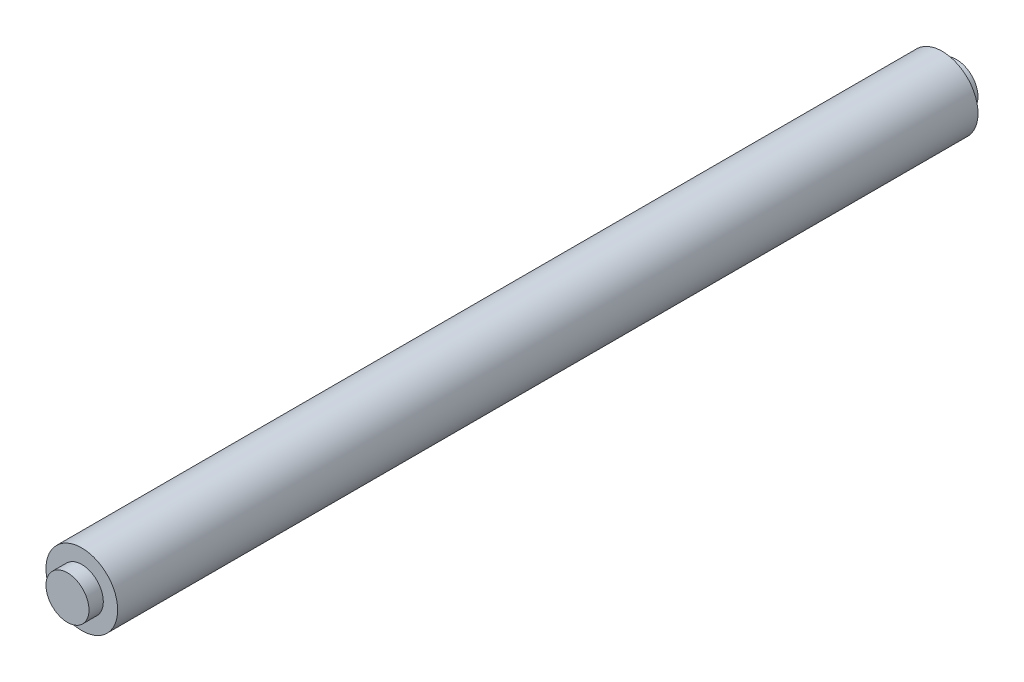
ISO-10303-21;
HEADER;
FILE_DESCRIPTION(('STEP AP214'),'2;1');
FILE_NAME('part.step','',(''),(''),'','','');
FILE_SCHEMA(('AUTOMOTIVE_DESIGN { 1 0 10303 214 1 1 1 1 }'));
ENDSEC;
DATA;
#1=APPLICATION_CONTEXT('core data for automotive mechanical design processes');
#2=APPLICATION_PROTOCOL_DEFINITION('international standard','automotive_design',2000,#1);
#3=PRODUCT_CONTEXT('',#1,'mechanical');
#4=PRODUCT('Part','Part','',(#3));
#5=PRODUCT_RELATED_PRODUCT_CATEGORY('part','',(#4));
#6=PRODUCT_DEFINITION_FORMATION('','',#4);
#7=PRODUCT_DEFINITION_CONTEXT('part definition',#1,'design');
#8=PRODUCT_DEFINITION('design','',#6,#7);
#9=PRODUCT_DEFINITION_SHAPE('','',#8);
#10=(LENGTH_UNIT() NAMED_UNIT(*) SI_UNIT(.MILLI.,.METRE.));
#11=(NAMED_UNIT(*) PLANE_ANGLE_UNIT() SI_UNIT($,.RADIAN.));
#12=(NAMED_UNIT(*) SI_UNIT($,.STERADIAN.) SOLID_ANGLE_UNIT());
#13=UNCERTAINTY_MEASURE_WITH_UNIT(LENGTH_MEASURE(1.E-05),#10,'distance_accuracy_value','');
#14=(GEOMETRIC_REPRESENTATION_CONTEXT(3) GLOBAL_UNCERTAINTY_ASSIGNED_CONTEXT((#13)) GLOBAL_UNIT_ASSIGNED_CONTEXT((#10,
#11,#12)) REPRESENTATION_CONTEXT('',''));
#15=CARTESIAN_POINT('',(0.,0.,0.));
#16=DIRECTION('',(0.,0.,1.));
#17=DIRECTION('',(1.,0.,0.));
#18=AXIS2_PLACEMENT_3D('',#15,#16,#17);
#19=CARTESIAN_POINT('',(0.,0.,600.));
#20=DIRECTION('',(0.,0.,-1.));
#21=DIRECTION('',(-1.,0.,0.));
#22=AXIS2_PLACEMENT_3D('',#19,#20,#21);
#23=CYLINDRICAL_SURFACE('',#22,25.);
#24=CARTESIAN_POINT('',(0.,0.,600.));
#25=DIRECTION('',(0.,0.,1.));
#26=DIRECTION('',(1.,0.,0.));
#27=AXIS2_PLACEMENT_3D('',#24,#25,#26);
#28=CIRCLE('',#27,25.);
#29=CARTESIAN_POINT('',(25.,0.,600.));
#30=VERTEX_POINT('',#29);
#31=EDGE_CURVE('E51',#30,#30,#28,.T.);
#32=ORIENTED_EDGE('',*,*,#31,.F.);
#33=EDGE_LOOP('',(#32));
#34=FACE_BOUND('',#33,.T.);
#35=CARTESIAN_POINT('',(0.,0.,0.));
#36=DIRECTION('',(0.,0.,1.));
#37=DIRECTION('',(1.,0.,0.));
#38=AXIS2_PLACEMENT_3D('',#35,#36,#37);
#39=CIRCLE('',#38,25.);
#40=CARTESIAN_POINT('',(25.,0.,0.));
#41=VERTEX_POINT('',#40);
#42=EDGE_CURVE('E40',#41,#41,#39,.T.);
#43=ORIENTED_EDGE('',*,*,#42,.T.);
#44=EDGE_LOOP('',(#43));
#45=FACE_BOUND('',#44,.T.);
#46=ADVANCED_FACE('F37',(#34,#45),#23,.T.);
#47=CARTESIAN_POINT('',(0.,0.,600.));
#48=DIRECTION('',(0.,0.,1.));
#49=DIRECTION('',(1.,0.,0.));
#50=AXIS2_PLACEMENT_3D('',#47,#48,#49);
#51=PLANE('',#50);
#52=CARTESIAN_POINT('',(0.,0.,600.));
#53=DIRECTION('',(0.,0.,1.));
#54=DIRECTION('',(1.,0.,0.));
#55=AXIS2_PLACEMENT_3D('',#52,#53,#54);
#56=CIRCLE('',#55,15.);
#57=CARTESIAN_POINT('',(15.,0.,600.));
#58=VERTEX_POINT('',#57);
#59=EDGE_CURVE('E45',#58,#58,#56,.T.);
#60=ORIENTED_EDGE('',*,*,#59,.F.);
#61=EDGE_LOOP('',(#60));
#62=FACE_BOUND('',#61,.T.);
#63=ORIENTED_EDGE('',*,*,#31,.T.);
#64=EDGE_LOOP('',(#63));
#65=FACE_BOUND('',#64,.T.);
#66=ADVANCED_FACE('F71',(#62,#65),#51,.T.);
#67=CARTESIAN_POINT('',(0.,0.,0.));
#68=DIRECTION('',(0.,0.,1.));
#69=DIRECTION('',(1.,0.,0.));
#70=AXIS2_PLACEMENT_3D('',#67,#68,#69);
#71=PLANE('',#70);
#72=CARTESIAN_POINT('',(0.,0.,0.));
#73=DIRECTION('',(0.,0.,-1.));
#74=DIRECTION('',(-1.,0.,0.));
#75=AXIS2_PLACEMENT_3D('',#72,#73,#74);
#76=CIRCLE('',#75,15.);
#77=CARTESIAN_POINT('',(-15.,0.,0.));
#78=VERTEX_POINT('',#77);
#79=EDGE_CURVE('E10',#78,#78,#76,.T.);
#80=ORIENTED_EDGE('',*,*,#79,.F.);
#81=EDGE_LOOP('',(#80));
#82=FACE_BOUND('',#81,.T.);
#83=ORIENTED_EDGE('',*,*,#42,.F.);
#84=EDGE_LOOP('',(#83));
#85=FACE_BOUND('',#84,.T.);
#86=ADVANCED_FACE('F68',(#82,#85),#71,.F.);
#87=CARTESIAN_POINT('',(0.,0.,610.));
#88=DIRECTION('',(0.,0.,-1.));
#89=DIRECTION('',(-1.,0.,0.));
#90=AXIS2_PLACEMENT_3D('',#87,#88,#89);
#91=CYLINDRICAL_SURFACE('',#90,15.);
#92=CARTESIAN_POINT('',(0.,0.,610.));
#93=DIRECTION('',(0.,0.,1.));
#94=DIRECTION('',(1.,0.,0.));
#95=AXIS2_PLACEMENT_3D('',#92,#93,#94);
#96=CIRCLE('',#95,15.);
#97=CARTESIAN_POINT('',(15.,0.,610.));
#98=VERTEX_POINT('',#97);
#99=EDGE_CURVE('E56',#98,#98,#96,.T.);
#100=ORIENTED_EDGE('',*,*,#99,.F.);
#101=EDGE_LOOP('',(#100));
#102=FACE_BOUND('',#101,.T.);
#103=ORIENTED_EDGE('',*,*,#59,.T.);
#104=EDGE_LOOP('',(#103));
#105=FACE_BOUND('',#104,.T.);
#106=ADVANCED_FACE('F70',(#102,#105),#91,.T.);
#107=CARTESIAN_POINT('',(0.,0.,610.));
#108=DIRECTION('',(0.,0.,1.));
#109=DIRECTION('',(1.,0.,0.));
#110=AXIS2_PLACEMENT_3D('',#107,#108,#109);
#111=PLANE('',#110);
#112=ORIENTED_EDGE('',*,*,#99,.T.);
#113=EDGE_LOOP('',(#112));
#114=FACE_BOUND('',#113,.T.);
#115=ADVANCED_FACE('F77',(#114),#111,.T.);
#116=CARTESIAN_POINT('',(0.,0.,-10.));
#117=DIRECTION('',(0.,0.,1.));
#118=DIRECTION('',(1.,0.,0.));
#119=AXIS2_PLACEMENT_3D('',#116,#117,#118);
#120=CYLINDRICAL_SURFACE('',#119,15.);
#121=CARTESIAN_POINT('',(0.,0.,-10.));
#122=DIRECTION('',(0.,0.,-1.));
#123=DIRECTION('',(-1.,0.,0.));
#124=AXIS2_PLACEMENT_3D('',#121,#122,#123);
#125=CIRCLE('',#124,15.);
#126=CARTESIAN_POINT('',(-15.,0.,-10.));
#127=VERTEX_POINT('',#126);
#128=EDGE_CURVE('E55',#127,#127,#125,.T.);
#129=ORIENTED_EDGE('',*,*,#128,.F.);
#130=EDGE_LOOP('',(#129));
#131=FACE_BOUND('',#130,.T.);
#132=ORIENTED_EDGE('',*,*,#79,.T.);
#133=EDGE_LOOP('',(#132));
#134=FACE_BOUND('',#133,.T.);
#135=ADVANCED_FACE('F105',(#131,#134),#120,.T.);
#136=CARTESIAN_POINT('',(0.,0.,-10.));
#137=DIRECTION('',(0.,0.,-1.));
#138=DIRECTION('',(-1.,0.,0.));
#139=AXIS2_PLACEMENT_3D('',#136,#137,#138);
#140=PLANE('',#139);
#141=ORIENTED_EDGE('',*,*,#128,.T.);
#142=EDGE_LOOP('',(#141));
#143=FACE_BOUND('',#142,.T.);
#144=ADVANCED_FACE('F119',(#143),#140,.T.);
#145=CLOSED_SHELL('',(#46,#66,#86,#106,#115,#135,#144));
#146=MANIFOLD_SOLID_BREP('B2',#145);
#147=ADVANCED_BREP_SHAPE_REPRESENTATION('',(#18,#146),#14);
#148=SHAPE_DEFINITION_REPRESENTATION(#9,#147);
ENDSEC;
END-ISO-10303-21;
